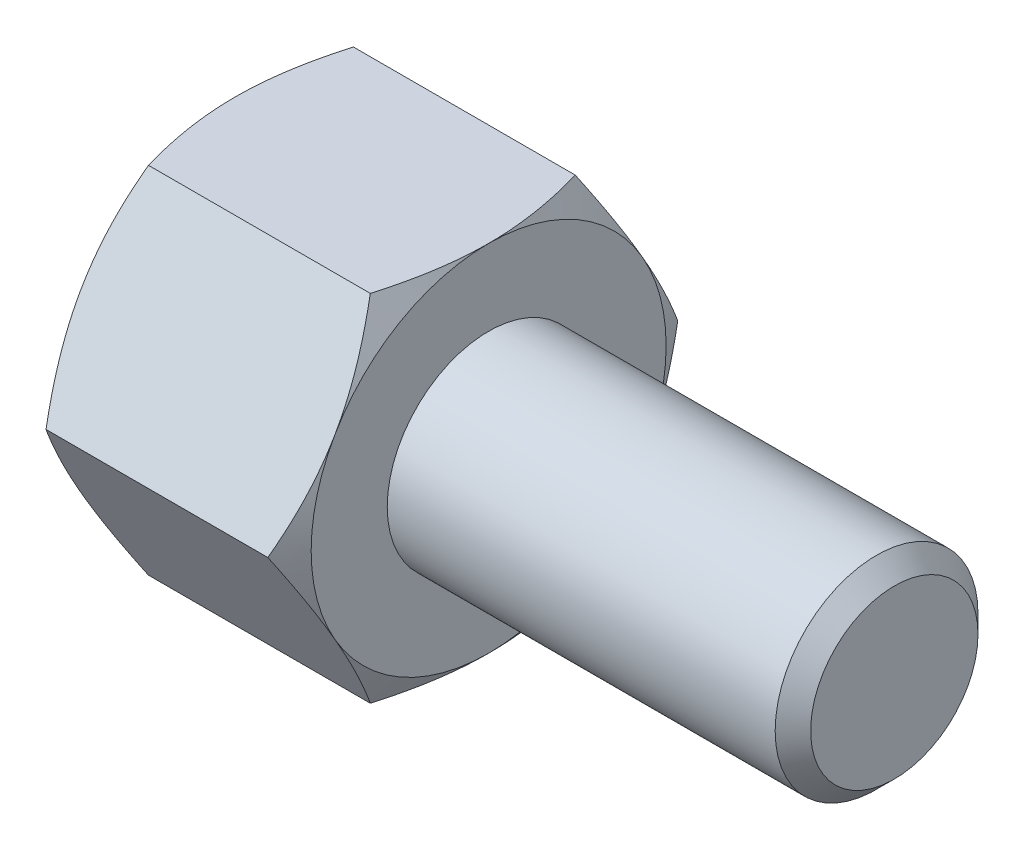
from build123d import *

# Parameters (mm, degrees)
EXTRUDE2_DEPTH = 2.5
SKETCH3_R      = 1.65
EXTRUDE3_DEPTH = 3
SKETCH5_R      = 2
EXTRUDE4_DEPTH = 8
CHAMFER1_SIZE  = 0.35


with BuildPart() as part:
    # Sketch1 → Extrude2 (new, symmetric)
    with BuildSketch(Plane(origin=(0, 0, 0), x_dir=(0, 0, -1), z_dir=(1, 0, 0))):
        Polygon((2.020725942, 3.5), (-2.020725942, 3.5), (-4.041451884, 0), (-2.020725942, -3.5), (2.020725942, -3.5), (4.041451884, 0), align=None)
    extrude(amount=EXTRUDE2_DEPTH, both=True)

    # Sketch2 → Cut-Revolve1 (revolve, cut)
    with BuildSketch(Plane.XY):
        with BuildLine():
            Line((-2.5, 3.5), (-1, 6.098076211))
            ThreePointArc((-1, 6.098076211), (-1.48810136, 7.276457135), (-2.5, 6.5))
            Line((-2.5, 6.5), (-2.5, 3.5))
        make_face()
    cut_revolve1 = revolve(axis=Axis((0, 0, 0), (1, 0, 0)), mode=Mode.SUBTRACT)

    # Mirror1: Cut-Revolve1 across plane
    add(cut_revolve1.mirror(Plane(origin=(0, 0, 0), x_dir=(0, 0, 1), z_dir=(1, 0, 0))), mode=Mode.SUBTRACT)

    # Sketch3 → Extrude3 (cut)
    with BuildSketch(Plane.ZY.offset(2.5)):
        Circle(SKETCH3_R)
    extrude(amount=-EXTRUDE3_DEPTH, mode=Mode.SUBTRACT)

    # Sketch4 → Cut-Revolve2 (revolve, cut)
    with BuildSketch(Plane.XY, mode=Mode.PRIVATE) as cut_revolve2_sk:
        Polygon((0.5, 0), (0.5, 1.65), (1.452627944, 0), align=None)
    revolve(cut_revolve2_sk.sketch.rotate(Axis((1.452627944, 0, 0), (-1, 0, 0)), 180), axis=Axis((1.452627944, 0, 0), (-1, 0, 0)), mode=Mode.SUBTRACT)

    # Sketch5 → Extrude4 (add)
    with BuildSketch(Plane(origin=(2.5, 0, 0), x_dir=(0, 0, -1), z_dir=(1, 0, 0))):
        Circle(SKETCH5_R)
    extrude(amount=EXTRUDE4_DEPTH)

    # Chamfer1
    chamfer1_edges = [part.edges().sort_by_distance(p)[0] for p in [
        (10.5, 0, 2),
    ]]
    chamfer(chamfer1_edges, length=CHAMFER1_SIZE)


solid = part.part
